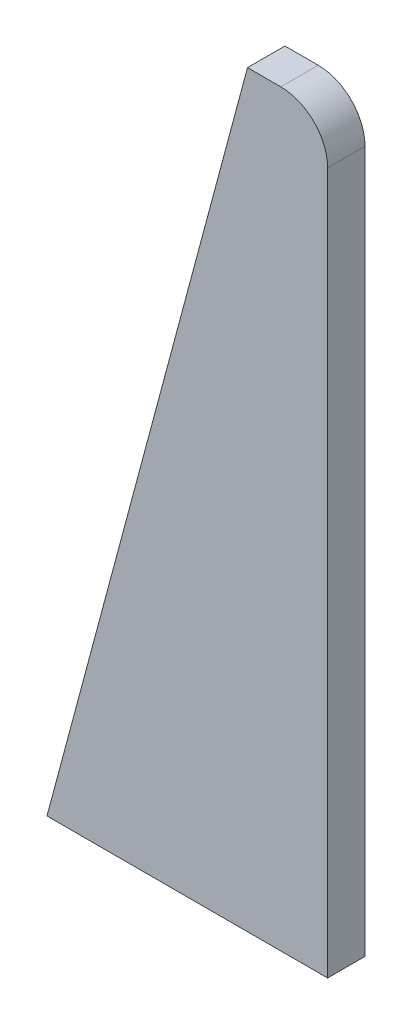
from build123d import *

# Parameters (mm, degrees)
DODANIE_WYCI_GNI_CIE1_DEPTH    = 8
OTW_R_GWINTOWANY_M5X0_81_D     = 4.2
OTW_R_GWINTOWANY_M5X0_81_DEPTH = 14
OTW_R_GWINTOWANY_M5X0_81_TIP   = 1.2618073
OTW_R_GWINTOWANY_M5X0_82_D     = 4.2
OTW_R_GWINTOWANY_M5X0_82_DEPTH = 14
OTW_R_GWINTOWANY_M5X0_82_TIP   = 1.2618073
ZAOKR_GLENIE1_R                = 10


with BuildPart() as part:
    # Szkic1 → Dodanie-wyci_gni_cie1 (new body)
    with BuildSketch(Plane.XY):
        Polygon((0, 0), (60, 0), (60, 160), (42.871870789, 160), align=None)
    extrude(amount=DODANIE_WYCI_GNI_CIE1_DEPTH)

    # Otw_r gwintowany M5x0.81
    with Locations(Plane(origin=(0, 0, 0), x_dir=(0, 0, 1), z_dir=(-0.9659258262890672, 0.25881904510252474, 0))):
        with Locations((4, 35), (4, 110)):
            Hole(OTW_R_GWINTOWANY_M5X0_81_D / 2, depth=OTW_R_GWINTOWANY_M5X0_81_DEPTH)
            with Locations((0, 0, -(OTW_R_GWINTOWANY_M5X0_81_DEPTH + OTW_R_GWINTOWANY_M5X0_81_TIP / 2))):  # 118° drill point
                Cone(0, OTW_R_GWINTOWANY_M5X0_81_D / 2, OTW_R_GWINTOWANY_M5X0_81_TIP, mode=Mode.SUBTRACT)

    # Otw_r gwintowany M5x0.82
    with Locations(Plane(origin=(0, 0, 0), x_dir=(-1, 0, 0), z_dir=(0, -1, 0))):
        with Locations((-22, -4), (-52, -4)):
            Hole(OTW_R_GWINTOWANY_M5X0_82_D / 2, depth=OTW_R_GWINTOWANY_M5X0_82_DEPTH)
            with Locations((0, 0, -(OTW_R_GWINTOWANY_M5X0_82_DEPTH + OTW_R_GWINTOWANY_M5X0_82_TIP / 2))):  # 118° drill point
                Cone(0, OTW_R_GWINTOWANY_M5X0_82_D / 2, OTW_R_GWINTOWANY_M5X0_82_TIP, mode=Mode.SUBTRACT)

    # Zaokr_glenie1
    zaokr_glenie1_edges = [part.edges().sort_by_distance(p)[0] for p in [
        (60, 160, 4),
    ]]
    fillet(zaokr_glenie1_edges, radius=ZAOKR_GLENIE1_R)


solid = part.part
